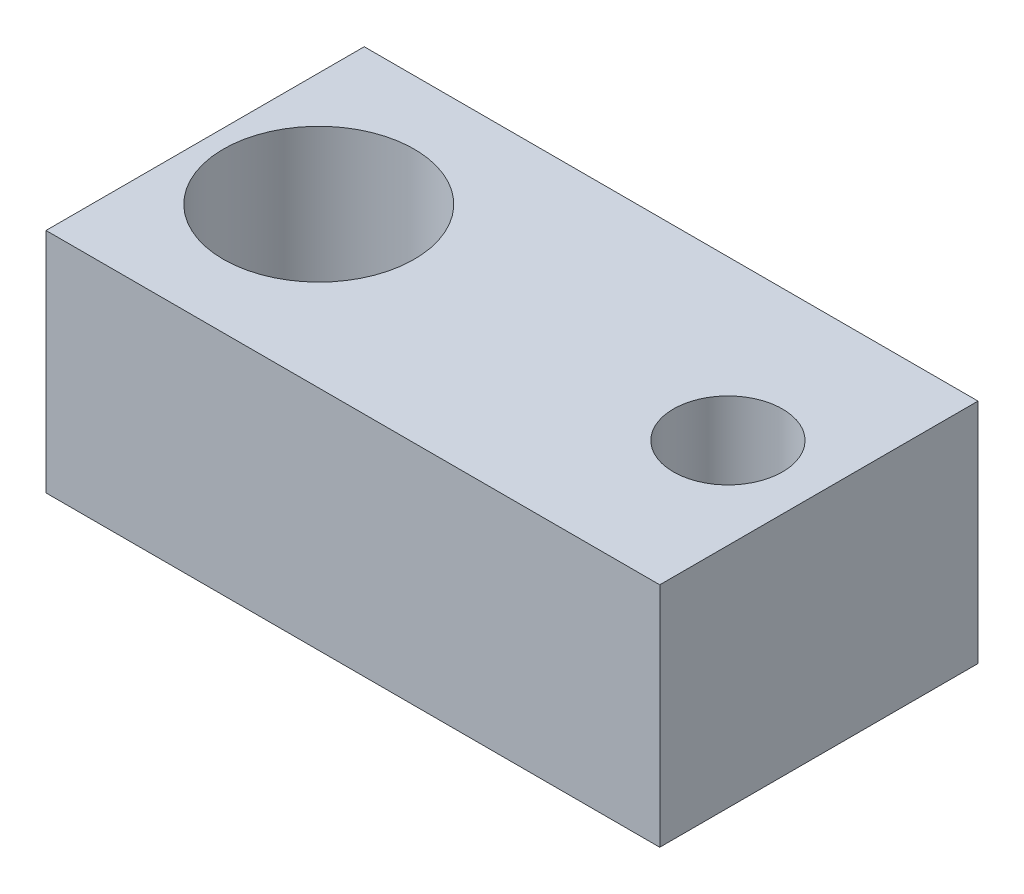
ISO-10303-21;
HEADER;
FILE_DESCRIPTION(('STEP AP214'),'2;1');
FILE_NAME('part.step','',(''),(''),'','','');
FILE_SCHEMA(('AUTOMOTIVE_DESIGN { 1 0 10303 214 1 1 1 1 }'));
ENDSEC;
DATA;
#1=APPLICATION_CONTEXT('core data for automotive mechanical design processes');
#2=APPLICATION_PROTOCOL_DEFINITION('international standard','automotive_design',2000,#1);
#3=PRODUCT_CONTEXT('',#1,'mechanical');
#4=PRODUCT('Part','Part','',(#3));
#5=PRODUCT_RELATED_PRODUCT_CATEGORY('part','',(#4));
#6=PRODUCT_DEFINITION_FORMATION('','',#4);
#7=PRODUCT_DEFINITION_CONTEXT('part definition',#1,'design');
#8=PRODUCT_DEFINITION('design','',#6,#7);
#9=PRODUCT_DEFINITION_SHAPE('','',#8);
#10=(LENGTH_UNIT() NAMED_UNIT(*) SI_UNIT(.MILLI.,.METRE.));
#11=(NAMED_UNIT(*) PLANE_ANGLE_UNIT() SI_UNIT($,.RADIAN.));
#12=(NAMED_UNIT(*) SI_UNIT($,.STERADIAN.) SOLID_ANGLE_UNIT());
#13=UNCERTAINTY_MEASURE_WITH_UNIT(LENGTH_MEASURE(1.E-05),#10,'distance_accuracy_value','');
#14=(GEOMETRIC_REPRESENTATION_CONTEXT(3) GLOBAL_UNCERTAINTY_ASSIGNED_CONTEXT((#13)) GLOBAL_UNIT_ASSIGNED_CONTEXT((#10,
#11,#12)) REPRESENTATION_CONTEXT('',''));
#15=CARTESIAN_POINT('',(0.,0.,0.));
#16=DIRECTION('',(0.,0.,1.));
#17=DIRECTION('',(1.,0.,0.));
#18=AXIS2_PLACEMENT_3D('',#15,#16,#17);
#19=CARTESIAN_POINT('',(0.,0.,70.));
#20=DIRECTION('',(1.,0.,0.));
#21=DIRECTION('',(0.,0.,-1.));
#22=AXIS2_PLACEMENT_3D('',#19,#20,#21);
#23=PLANE('',#22);
#24=DIRECTION('',(0.,-1.,0.));
#25=VECTOR('',#24,1.);
#26=CARTESIAN_POINT('',(0.,0.,0.));
#27=LINE('',#26,#25);
#28=CARTESIAN_POINT('',(0.,50.,0.));
#29=VERTEX_POINT('',#28);
#30=CARTESIAN_POINT('',(0.,0.,0.));
#31=VERTEX_POINT('',#30);
#32=EDGE_CURVE('E68',#29,#31,#27,.T.);
#33=ORIENTED_EDGE('',*,*,#32,.T.);
#34=DIRECTION('',(0.,0.,-1.));
#35=VECTOR('',#34,1.);
#36=CARTESIAN_POINT('',(0.,0.,70.));
#37=LINE('',#36,#35);
#38=CARTESIAN_POINT('',(0.,0.,70.));
#39=VERTEX_POINT('',#38);
#40=EDGE_CURVE('E11',#39,#31,#37,.T.);
#41=ORIENTED_EDGE('',*,*,#40,.F.);
#42=DIRECTION('',(0.,-1.,0.));
#43=VECTOR('',#42,1.);
#44=CARTESIAN_POINT('',(0.,0.,70.));
#45=LINE('',#44,#43);
#46=CARTESIAN_POINT('',(0.,50.,70.));
#47=VERTEX_POINT('',#46);
#48=EDGE_CURVE('E91',#47,#39,#45,.T.);
#49=ORIENTED_EDGE('',*,*,#48,.F.);
#50=DIRECTION('',(0.,0.,-1.));
#51=VECTOR('',#50,1.);
#52=CARTESIAN_POINT('',(0.,50.,70.));
#53=LINE('',#52,#51);
#54=EDGE_CURVE('E80',#47,#29,#53,.T.);
#55=ORIENTED_EDGE('',*,*,#54,.T.);
#56=EDGE_LOOP('',(#33,#41,#49,#55));
#57=FACE_BOUND('',#56,.T.);
#58=ADVANCED_FACE('F24',(#57),#23,.F.);
#59=CARTESIAN_POINT('',(0.,0.,70.));
#60=DIRECTION('',(0.,1.,0.));
#61=DIRECTION('',(0.,0.,1.));
#62=AXIS2_PLACEMENT_3D('',#59,#60,#61);
#63=PLANE('',#62);
#64=CARTESIAN_POINT('',(115.,0.,35.));
#65=DIRECTION('',(0.,1.,0.));
#66=DIRECTION('',(0.,0.,1.));
#67=AXIS2_PLACEMENT_3D('',#64,#65,#66);
#68=CIRCLE('',#67,12.);
#69=CARTESIAN_POINT('',(115.,0.,47.));
#70=VERTEX_POINT('',#69);
#71=EDGE_CURVE('E126',#70,#70,#68,.T.);
#72=ORIENTED_EDGE('',*,*,#71,.T.);
#73=EDGE_LOOP('',(#72));
#74=FACE_BOUND('',#73,.T.);
#75=CARTESIAN_POINT('',(25.,0.,35.));
#76=DIRECTION('',(0.,1.,0.));
#77=DIRECTION('',(0.,0.,1.));
#78=AXIS2_PLACEMENT_3D('',#75,#76,#77);
#79=CIRCLE('',#78,21.);
#80=CARTESIAN_POINT('',(25.,0.,56.));
#81=VERTEX_POINT('',#80);
#82=EDGE_CURVE('E81',#81,#81,#79,.T.);
#83=ORIENTED_EDGE('',*,*,#82,.T.);
#84=EDGE_LOOP('',(#83));
#85=FACE_BOUND('',#84,.T.);
#86=DIRECTION('',(1.,0.,0.));
#87=VECTOR('',#86,1.);
#88=CARTESIAN_POINT('',(0.,0.,0.));
#89=LINE('',#88,#87);
#90=CARTESIAN_POINT('',(135.,0.,0.));
#91=VERTEX_POINT('',#90);
#92=EDGE_CURVE('E64',#31,#91,#89,.T.);
#93=ORIENTED_EDGE('',*,*,#92,.T.);
#94=DIRECTION('',(0.,0.,-1.));
#95=VECTOR('',#94,1.);
#96=CARTESIAN_POINT('',(135.,0.,70.));
#97=LINE('',#96,#95);
#98=CARTESIAN_POINT('',(135.,0.,70.));
#99=VERTEX_POINT('',#98);
#100=EDGE_CURVE('E31',#99,#91,#97,.T.);
#101=ORIENTED_EDGE('',*,*,#100,.F.);
#102=DIRECTION('',(1.,0.,0.));
#103=VECTOR('',#102,1.);
#104=CARTESIAN_POINT('',(0.,0.,70.));
#105=LINE('',#104,#103);
#106=EDGE_CURVE('E76',#39,#99,#105,.T.);
#107=ORIENTED_EDGE('',*,*,#106,.F.);
#108=ORIENTED_EDGE('',*,*,#40,.T.);
#109=EDGE_LOOP('',(#93,#101,#107,#108));
#110=FACE_BOUND('',#109,.T.);
#111=ADVANCED_FACE('F75',(#74,#85,#110),#63,.F.);
#112=CARTESIAN_POINT('',(135.,0.,70.));
#113=DIRECTION('',(-1.,0.,0.));
#114=DIRECTION('',(0.,0.,1.));
#115=AXIS2_PLACEMENT_3D('',#112,#113,#114);
#116=PLANE('',#115);
#117=DIRECTION('',(0.,1.,0.));
#118=VECTOR('',#117,1.);
#119=CARTESIAN_POINT('',(135.,0.,0.));
#120=LINE('',#119,#118);
#121=CARTESIAN_POINT('',(135.,50.,0.));
#122=VERTEX_POINT('',#121);
#123=EDGE_CURVE('E69',#91,#122,#120,.T.);
#124=ORIENTED_EDGE('',*,*,#123,.T.);
#125=DIRECTION('',(0.,0.,-1.));
#126=VECTOR('',#125,1.);
#127=CARTESIAN_POINT('',(135.,50.,70.));
#128=LINE('',#127,#126);
#129=CARTESIAN_POINT('',(135.,50.,70.));
#130=VERTEX_POINT('',#129);
#131=EDGE_CURVE('E97',#130,#122,#128,.T.);
#132=ORIENTED_EDGE('',*,*,#131,.F.);
#133=DIRECTION('',(0.,1.,0.));
#134=VECTOR('',#133,1.);
#135=CARTESIAN_POINT('',(135.,0.,70.));
#136=LINE('',#135,#134);
#137=EDGE_CURVE('E43',#99,#130,#136,.T.);
#138=ORIENTED_EDGE('',*,*,#137,.F.);
#139=ORIENTED_EDGE('',*,*,#100,.T.);
#140=EDGE_LOOP('',(#124,#132,#138,#139));
#141=FACE_BOUND('',#140,.T.);
#142=ADVANCED_FACE('F100',(#141),#116,.F.);
#143=CARTESIAN_POINT('',(0.,50.,70.));
#144=DIRECTION('',(0.,-1.,0.));
#145=DIRECTION('',(0.,0.,-1.));
#146=AXIS2_PLACEMENT_3D('',#143,#144,#145);
#147=PLANE('',#146);
#148=CARTESIAN_POINT('',(115.,50.,35.));
#149=DIRECTION('',(0.,1.,0.));
#150=DIRECTION('',(0.,0.,1.));
#151=AXIS2_PLACEMENT_3D('',#148,#149,#150);
#152=CIRCLE('',#151,12.);
#153=CARTESIAN_POINT('',(115.,50.,47.));
#154=VERTEX_POINT('',#153);
#155=EDGE_CURVE('E136',#154,#154,#152,.T.);
#156=ORIENTED_EDGE('',*,*,#155,.F.);
#157=EDGE_LOOP('',(#156));
#158=FACE_BOUND('',#157,.T.);
#159=CARTESIAN_POINT('',(25.,50.,35.));
#160=DIRECTION('',(0.,1.,0.));
#161=DIRECTION('',(0.,0.,1.));
#162=AXIS2_PLACEMENT_3D('',#159,#160,#161);
#163=CIRCLE('',#162,21.);
#164=CARTESIAN_POINT('',(25.,50.,56.));
#165=VERTEX_POINT('',#164);
#166=EDGE_CURVE('E84',#165,#165,#163,.T.);
#167=ORIENTED_EDGE('',*,*,#166,.F.);
#168=EDGE_LOOP('',(#167));
#169=FACE_BOUND('',#168,.T.);
#170=DIRECTION('',(-1.,0.,0.));
#171=VECTOR('',#170,1.);
#172=CARTESIAN_POINT('',(0.,50.,0.));
#173=LINE('',#172,#171);
#174=EDGE_CURVE('E89',#122,#29,#173,.T.);
#175=ORIENTED_EDGE('',*,*,#174,.T.);
#176=ORIENTED_EDGE('',*,*,#54,.F.);
#177=DIRECTION('',(-1.,0.,0.));
#178=VECTOR('',#177,1.);
#179=CARTESIAN_POINT('',(0.,50.,70.));
#180=LINE('',#179,#178);
#181=EDGE_CURVE('E38',#130,#47,#180,.T.);
#182=ORIENTED_EDGE('',*,*,#181,.F.);
#183=ORIENTED_EDGE('',*,*,#131,.T.);
#184=EDGE_LOOP('',(#175,#176,#182,#183));
#185=FACE_BOUND('',#184,.T.);
#186=ADVANCED_FACE('F102',(#158,#169,#185),#147,.F.);
#187=CARTESIAN_POINT('',(0.,50.,70.));
#188=DIRECTION('',(0.,0.,-1.));
#189=DIRECTION('',(-1.,0.,0.));
#190=AXIS2_PLACEMENT_3D('',#187,#188,#189);
#191=PLANE('',#190);
#192=ORIENTED_EDGE('',*,*,#48,.T.);
#193=ORIENTED_EDGE('',*,*,#106,.T.);
#194=ORIENTED_EDGE('',*,*,#137,.T.);
#195=ORIENTED_EDGE('',*,*,#181,.T.);
#196=EDGE_LOOP('',(#192,#193,#194,#195));
#197=FACE_BOUND('',#196,.T.);
#198=ADVANCED_FACE('F103',(#197),#191,.F.);
#199=CARTESIAN_POINT('',(0.,50.,0.));
#200=DIRECTION('',(0.,0.,-1.));
#201=DIRECTION('',(-1.,0.,0.));
#202=AXIS2_PLACEMENT_3D('',#199,#200,#201);
#203=PLANE('',#202);
#204=ORIENTED_EDGE('',*,*,#32,.F.);
#205=ORIENTED_EDGE('',*,*,#174,.F.);
#206=ORIENTED_EDGE('',*,*,#123,.F.);
#207=ORIENTED_EDGE('',*,*,#92,.F.);
#208=EDGE_LOOP('',(#204,#205,#206,#207));
#209=FACE_BOUND('',#208,.T.);
#210=ADVANCED_FACE('F65',(#209),#203,.T.);
#211=CARTESIAN_POINT('',(25.,0.,35.));
#212=DIRECTION('',(0.,1.,0.));
#213=DIRECTION('',(0.,0.,1.));
#214=AXIS2_PLACEMENT_3D('',#211,#212,#213);
#215=CYLINDRICAL_SURFACE('',#214,21.);
#216=ORIENTED_EDGE('',*,*,#82,.F.);
#217=EDGE_LOOP('',(#216));
#218=FACE_BOUND('',#217,.T.);
#219=ORIENTED_EDGE('',*,*,#166,.T.);
#220=EDGE_LOOP('',(#219));
#221=FACE_BOUND('',#220,.T.);
#222=ADVANCED_FACE('F110',(#218,#221),#215,.F.);
#223=CARTESIAN_POINT('',(115.,0.,35.));
#224=DIRECTION('',(0.,1.,0.));
#225=DIRECTION('',(0.,0.,1.));
#226=AXIS2_PLACEMENT_3D('',#223,#224,#225);
#227=CYLINDRICAL_SURFACE('',#226,12.);
#228=ORIENTED_EDGE('',*,*,#71,.F.);
#229=EDGE_LOOP('',(#228));
#230=FACE_BOUND('',#229,.T.);
#231=ORIENTED_EDGE('',*,*,#155,.T.);
#232=EDGE_LOOP('',(#231));
#233=FACE_BOUND('',#232,.T.);
#234=ADVANCED_FACE('F131',(#230,#233),#227,.F.);
#235=CLOSED_SHELL('',(#58,#111,#142,#186,#198,#210,#222,#234));
#236=MANIFOLD_SOLID_BREP('B2',#235);
#237=ADVANCED_BREP_SHAPE_REPRESENTATION('',(#18,#236),#14);
#238=SHAPE_DEFINITION_REPRESENTATION(#9,#237);
ENDSEC;
END-ISO-10303-21;
